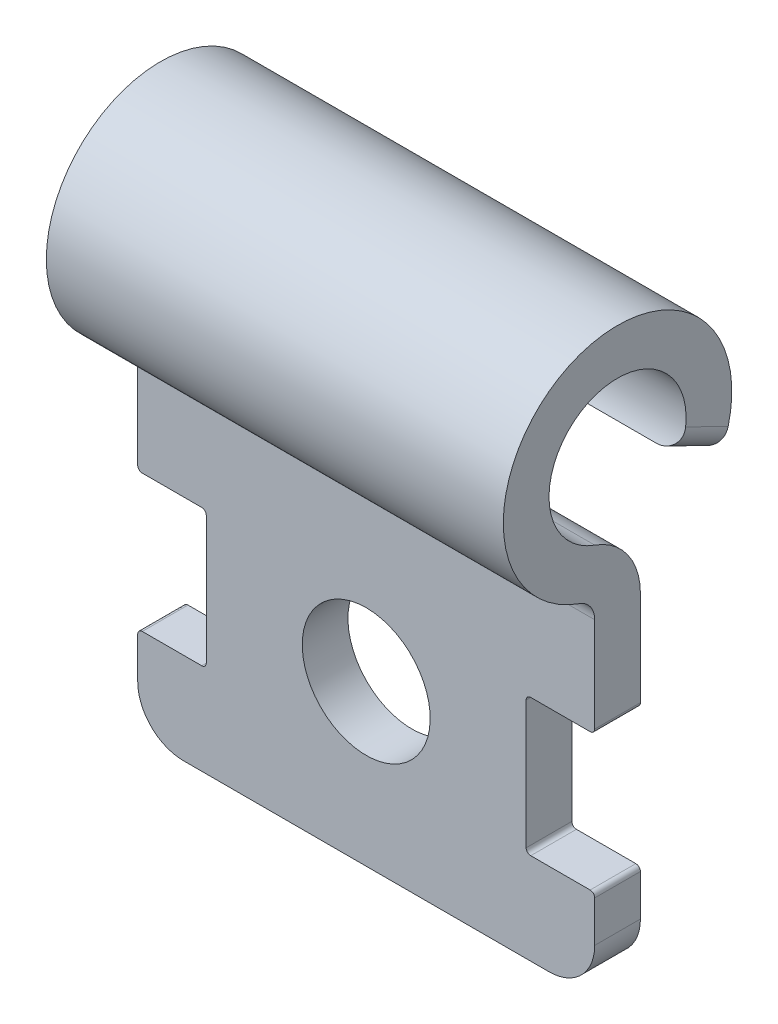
ISO-10303-21;
HEADER;
FILE_DESCRIPTION(('STEP AP214'),'2;1');
FILE_NAME('part.step','',(''),(''),'','','');
FILE_SCHEMA(('AUTOMOTIVE_DESIGN { 1 0 10303 214 1 1 1 1 }'));
ENDSEC;
DATA;
#1=APPLICATION_CONTEXT('core data for automotive mechanical design processes');
#2=APPLICATION_PROTOCOL_DEFINITION('international standard','automotive_design',2000,#1);
#3=PRODUCT_CONTEXT('',#1,'mechanical');
#4=PRODUCT('Part','Part','',(#3));
#5=PRODUCT_RELATED_PRODUCT_CATEGORY('part','',(#4));
#6=PRODUCT_DEFINITION_FORMATION('','',#4);
#7=PRODUCT_DEFINITION_CONTEXT('part definition',#1,'design');
#8=PRODUCT_DEFINITION('design','',#6,#7);
#9=PRODUCT_DEFINITION_SHAPE('','',#8);
#10=(LENGTH_UNIT() NAMED_UNIT(*) SI_UNIT(.MILLI.,.METRE.));
#11=(NAMED_UNIT(*) PLANE_ANGLE_UNIT() SI_UNIT($,.RADIAN.));
#12=(NAMED_UNIT(*) SI_UNIT($,.STERADIAN.) SOLID_ANGLE_UNIT());
#13=UNCERTAINTY_MEASURE_WITH_UNIT(LENGTH_MEASURE(1.E-05),#10,'distance_accuracy_value','');
#14=(GEOMETRIC_REPRESENTATION_CONTEXT(3) GLOBAL_UNCERTAINTY_ASSIGNED_CONTEXT((#13)) GLOBAL_UNIT_ASSIGNED_CONTEXT((#10,
#11,#12)) REPRESENTATION_CONTEXT('',''));
#15=CARTESIAN_POINT('',(0.,0.,0.));
#16=DIRECTION('',(0.,0.,1.));
#17=DIRECTION('',(1.,0.,0.));
#18=AXIS2_PLACEMENT_3D('',#15,#16,#17);
#19=CARTESIAN_POINT('',(10.,-2.82842712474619,1.));
#20=DIRECTION('',(1.,0.,0.));
#21=DIRECTION('',(0.,0.,-1.));
#22=AXIS2_PLACEMENT_3D('',#19,#20,#21);
#23=PLANE('',#22);
#24=DIRECTION('',(0.,-1.,0.));
#25=VECTOR('',#24,1.);
#26=CARTESIAN_POINT('',(10.,-2.82842712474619,-0.5));
#27=LINE('',#26,#25);
#28=CARTESIAN_POINT('',(10.,-8.1,-0.500000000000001));
#29=VERTEX_POINT('',#28);
#30=CARTESIAN_POINT('',(10.,-9.,-0.500000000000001));
#31=VERTEX_POINT('',#30);
#32=EDGE_CURVE('E243',#29,#31,#27,.T.);
#33=ORIENTED_EDGE('',*,*,#32,.F.);
#34=DIRECTION('',(0.,0.,-1.));
#35=VECTOR('',#34,1.);
#36=CARTESIAN_POINT('',(10.,-8.1,0.5));
#37=LINE('',#36,#35);
#38=CARTESIAN_POINT('',(10.,-8.1,0.499999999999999));
#39=VERTEX_POINT('',#38);
#40=EDGE_CURVE('E457',#29,#39,#37,.F.);
#41=ORIENTED_EDGE('',*,*,#40,.T.);
#42=DIRECTION('',(0.,-1.,0.));
#43=VECTOR('',#42,1.);
#44=CARTESIAN_POINT('',(10.,-2.82842712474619,0.5));
#45=LINE('',#44,#43);
#46=CARTESIAN_POINT('',(10.,-9.,0.499999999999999));
#47=VERTEX_POINT('',#46);
#48=EDGE_CURVE('E272',#39,#47,#45,.T.);
#49=ORIENTED_EDGE('',*,*,#48,.T.);
#50=DIRECTION('',(0.,0.,1.));
#51=VECTOR('',#50,1.);
#52=CARTESIAN_POINT('',(10.,-9.,1.));
#53=LINE('',#52,#51);
#54=EDGE_CURVE('E532',#47,#31,#53,.F.);
#55=ORIENTED_EDGE('',*,*,#54,.T.);
#56=EDGE_LOOP('',(#33,#41,#49,#55));
#57=FACE_BOUND('',#56,.T.);
#58=ADVANCED_FACE('F35',(#57),#23,.T.);
#59=CARTESIAN_POINT('',(0.,-2.82842712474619,1.));
#60=DIRECTION('',(1.,0.,0.));
#61=DIRECTION('',(0.,0.,-1.));
#62=AXIS2_PLACEMENT_3D('',#59,#60,#61);
#63=PLANE('',#62);
#64=DIRECTION('',(0.,-1.,0.));
#65=VECTOR('',#64,1.);
#66=CARTESIAN_POINT('',(0.,-2.82842712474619,-0.5));
#67=LINE('',#66,#65);
#68=CARTESIAN_POINT('',(0.,-2.82842712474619,-0.5));
#69=VERTEX_POINT('',#68);
#70=CARTESIAN_POINT('',(0.,-4.9,-0.500000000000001));
#71=VERTEX_POINT('',#70);
#72=EDGE_CURVE('E227',#69,#71,#67,.T.);
#73=ORIENTED_EDGE('',*,*,#72,.T.);
#74=DIRECTION('',(0.,0.,1.));
#75=VECTOR('',#74,1.);
#76=CARTESIAN_POINT('',(0.,-4.9,1.));
#77=LINE('',#76,#75);
#78=CARTESIAN_POINT('',(0.,-4.9,0.499999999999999));
#79=VERTEX_POINT('',#78);
#80=EDGE_CURVE('E389',#71,#79,#77,.T.);
#81=ORIENTED_EDGE('',*,*,#80,.T.);
#82=DIRECTION('',(0.,-1.,0.));
#83=VECTOR('',#82,1.);
#84=CARTESIAN_POINT('',(0.,-2.82842712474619,0.5));
#85=LINE('',#84,#83);
#86=CARTESIAN_POINT('',(0.,-2.82842712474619,0.5));
#87=VERTEX_POINT('',#86);
#88=EDGE_CURVE('E258',#87,#79,#85,.T.);
#89=ORIENTED_EDGE('',*,*,#88,.F.);
#90=CARTESIAN_POINT('',(0.,-2.82842712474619,1.));
#91=DIRECTION('',(-1.,0.,0.));
#92=DIRECTION('',(0.,0.,-1.));
#93=AXIS2_PLACEMENT_3D('',#90,#91,#92);
#94=CIRCLE('',#93,0.5);
#95=CARTESIAN_POINT('',(0.,-2.35702260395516,0.833333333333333));
#96=VERTEX_POINT('',#95);
#97=EDGE_CURVE('E270',#96,#87,#94,.T.);
#98=ORIENTED_EDGE('',*,*,#97,.F.);
#99=CARTESIAN_POINT('',(0.,0.,0.));
#100=DIRECTION('',(1.,0.,0.));
#101=DIRECTION('',(0.,0.,-1.));
#102=AXIS2_PLACEMENT_3D('',#99,#100,#101);
#103=CIRCLE('',#102,2.5);
#104=CARTESIAN_POINT('',(0.,-0.624305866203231,-2.42079370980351));
#105=VERTEX_POINT('',#104);
#106=EDGE_CURVE('E268',#105,#96,#103,.T.);
#107=ORIENTED_EDGE('',*,*,#106,.F.);
#108=DIRECTION('',(0.,0.43834042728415,0.898809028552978));
#109=VECTOR('',#108,1.);
#110=CARTESIAN_POINT('',(0.,-0.208106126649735,-1.56738375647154));
#111=LINE('',#110,#109);
#112=CARTESIAN_POINT('',(0.,-0.170502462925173,-1.49027813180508));
#113=VERTEX_POINT('',#112);
#114=EDGE_CURVE('E296',#105,#113,#111,.T.);
#115=ORIENTED_EDGE('',*,*,#114,.T.);
#116=CARTESIAN_POINT('',(0.,0.,0.));
#117=DIRECTION('',(1.,0.,0.));
#118=DIRECTION('',(0.,0.,-1.));
#119=AXIS2_PLACEMENT_3D('',#116,#117,#118);
#120=CIRCLE('',#119,1.5);
#121=CARTESIAN_POINT('',(0.,-1.41421356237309,0.5));
#122=VERTEX_POINT('',#121);
#123=EDGE_CURVE('E266',#113,#122,#120,.T.);
#124=ORIENTED_EDGE('',*,*,#123,.T.);
#125=CARTESIAN_POINT('',(0.,-2.82842712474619,1.));
#126=DIRECTION('',(1.,0.,0.));
#127=DIRECTION('',(0.,0.,-1.));
#128=AXIS2_PLACEMENT_3D('',#125,#126,#127);
#129=CIRCLE('',#128,1.5);
#130=EDGE_CURVE('E264',#122,#69,#129,.F.);
#131=ORIENTED_EDGE('',*,*,#130,.T.);
#132=EDGE_LOOP('',(#73,#81,#89,#98,#107,#115,#124,#131));
#133=FACE_BOUND('',#132,.T.);
#134=ADVANCED_FACE('F357',(#133),#63,.F.);
#135=CARTESIAN_POINT('',(10.,-2.82842712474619,0.5));
#136=DIRECTION('',(0.,0.,-1.));
#137=DIRECTION('',(0.,1.,0.));
#138=AXIS2_PLACEMENT_3D('',#135,#136,#137);
#139=PLANE('',#138);
#140=CARTESIAN_POINT('',(5.,-6.5,0.499999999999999));
#141=DIRECTION('',(0.,0.,-1.));
#142=DIRECTION('',(0.,1.,0.));
#143=AXIS2_PLACEMENT_3D('',#140,#141,#142);
#144=CIRCLE('',#143,1.4);
#145=CARTESIAN_POINT('',(5.,-5.1,0.499999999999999));
#146=VERTEX_POINT('',#145);
#147=EDGE_CURVE('E569',#146,#146,#144,.T.);
#148=ORIENTED_EDGE('',*,*,#147,.T.);
#149=EDGE_LOOP('',(#148));
#150=FACE_BOUND('',#149,.T.);
#151=ORIENTED_EDGE('',*,*,#48,.F.);
#152=CARTESIAN_POINT('',(9.9,-8.1,0.499999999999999));
#153=DIRECTION('',(0.,0.,-1.));
#154=DIRECTION('',(0.,1.,0.));
#155=AXIS2_PLACEMENT_3D('',#152,#153,#154);
#156=CIRCLE('',#155,0.1);
#157=CARTESIAN_POINT('',(9.9,-8.,0.5));
#158=VERTEX_POINT('',#157);
#159=EDGE_CURVE('E464',#39,#158,#156,.F.);
#160=ORIENTED_EDGE('',*,*,#159,.T.);
#161=DIRECTION('',(1.,0.,0.));
#162=VECTOR('',#161,1.);
#163=CARTESIAN_POINT('',(10.,-8.,0.5));
#164=LINE('',#163,#162);
#165=CARTESIAN_POINT('',(8.6,-8.,0.5));
#166=VERTEX_POINT('',#165);
#167=EDGE_CURVE('E547',#166,#158,#164,.T.);
#168=ORIENTED_EDGE('',*,*,#167,.F.);
#169=CARTESIAN_POINT('',(8.6,-7.9,0.499999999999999));
#170=DIRECTION('',(0.,0.,-1.));
#171=DIRECTION('',(0.,1.,0.));
#172=AXIS2_PLACEMENT_3D('',#169,#170,#171);
#173=CIRCLE('',#172,0.1);
#174=CARTESIAN_POINT('',(8.5,-7.9,0.5));
#175=VERTEX_POINT('',#174);
#176=EDGE_CURVE('E392',#166,#175,#173,.T.);
#177=ORIENTED_EDGE('',*,*,#176,.T.);
#178=DIRECTION('',(0.,-1.,0.));
#179=VECTOR('',#178,1.);
#180=CARTESIAN_POINT('',(8.5,-8.,0.5));
#181=LINE('',#180,#179);
#182=CARTESIAN_POINT('',(8.5,-5.1,0.5));
#183=VERTEX_POINT('',#182);
#184=EDGE_CURVE('E557',#183,#175,#181,.T.);
#185=ORIENTED_EDGE('',*,*,#184,.F.);
#186=CARTESIAN_POINT('',(8.6,-5.1,0.499999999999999));
#187=DIRECTION('',(0.,0.,-1.));
#188=DIRECTION('',(0.,1.,0.));
#189=AXIS2_PLACEMENT_3D('',#186,#187,#188);
#190=CIRCLE('',#189,0.1);
#191=CARTESIAN_POINT('',(8.6,-5.,0.5));
#192=VERTEX_POINT('',#191);
#193=EDGE_CURVE('E403',#183,#192,#190,.T.);
#194=ORIENTED_EDGE('',*,*,#193,.T.);
#195=DIRECTION('',(-1.,0.,0.));
#196=VECTOR('',#195,1.);
#197=CARTESIAN_POINT('',(10.,-5.,0.5));
#198=LINE('',#197,#196);
#199=CARTESIAN_POINT('',(9.9,-5.,0.5));
#200=VERTEX_POINT('',#199);
#201=EDGE_CURVE('E554',#200,#192,#198,.T.);
#202=ORIENTED_EDGE('',*,*,#201,.F.);
#203=CARTESIAN_POINT('',(9.9,-4.9,0.499999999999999));
#204=DIRECTION('',(0.,0.,-1.));
#205=DIRECTION('',(0.,1.,0.));
#206=AXIS2_PLACEMENT_3D('',#203,#204,#205);
#207=CIRCLE('',#206,0.1);
#208=CARTESIAN_POINT('',(10.,-4.9,0.499999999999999));
#209=VERTEX_POINT('',#208);
#210=EDGE_CURVE('E462',#200,#209,#207,.F.);
#211=ORIENTED_EDGE('',*,*,#210,.T.);
#212=CARTESIAN_POINT('',(10.,-2.82842712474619,0.5));
#213=VERTEX_POINT('',#212);
#214=EDGE_CURVE('E386',#213,#209,#45,.T.);
#215=ORIENTED_EDGE('',*,*,#214,.F.);
#216=DIRECTION('',(-1.,0.,0.));
#217=VECTOR('',#216,1.);
#218=CARTESIAN_POINT('',(10.,-2.82842712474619,0.5));
#219=LINE('',#218,#217);
#220=EDGE_CURVE('E257',#213,#87,#219,.T.);
#221=ORIENTED_EDGE('',*,*,#220,.T.);
#222=ORIENTED_EDGE('',*,*,#88,.T.);
#223=CARTESIAN_POINT('',(0.1,-4.9,0.499999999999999));
#224=DIRECTION('',(0.,0.,-1.));
#225=DIRECTION('',(0.,1.,0.));
#226=AXIS2_PLACEMENT_3D('',#223,#224,#225);
#227=CIRCLE('',#226,0.1);
#228=CARTESIAN_POINT('',(0.0999999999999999,-5.,0.5));
#229=VERTEX_POINT('',#228);
#230=EDGE_CURVE('E459',#79,#229,#227,.F.);
#231=ORIENTED_EDGE('',*,*,#230,.T.);
#232=DIRECTION('',(-1.,0.,0.));
#233=VECTOR('',#232,1.);
#234=CARTESIAN_POINT('',(0.,-5.,0.5));
#235=LINE('',#234,#233);
#236=CARTESIAN_POINT('',(1.4,-5.,0.5));
#237=VERTEX_POINT('',#236);
#238=EDGE_CURVE('E413',#237,#229,#235,.T.);
#239=ORIENTED_EDGE('',*,*,#238,.F.);
#240=CARTESIAN_POINT('',(1.4,-5.1,0.499999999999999));
#241=DIRECTION('',(0.,0.,-1.));
#242=DIRECTION('',(0.,1.,0.));
#243=AXIS2_PLACEMENT_3D('',#240,#241,#242);
#244=CIRCLE('',#243,0.1);
#245=CARTESIAN_POINT('',(1.5,-5.1,0.5));
#246=VERTEX_POINT('',#245);
#247=EDGE_CURVE('E43',#237,#246,#244,.T.);
#248=ORIENTED_EDGE('',*,*,#247,.T.);
#249=DIRECTION('',(0.,1.,0.));
#250=VECTOR('',#249,1.);
#251=CARTESIAN_POINT('',(1.5,-8.,0.5));
#252=LINE('',#251,#250);
#253=CARTESIAN_POINT('',(1.5,-7.9,0.5));
#254=VERTEX_POINT('',#253);
#255=EDGE_CURVE('E411',#254,#246,#252,.T.);
#256=ORIENTED_EDGE('',*,*,#255,.F.);
#257=CARTESIAN_POINT('',(1.4,-7.9,0.499999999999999));
#258=DIRECTION('',(0.,0.,-1.));
#259=DIRECTION('',(0.,1.,0.));
#260=AXIS2_PLACEMENT_3D('',#257,#258,#259);
#261=CIRCLE('',#260,0.1);
#262=CARTESIAN_POINT('',(1.4,-8.,0.5));
#263=VERTEX_POINT('',#262);
#264=EDGE_CURVE('E56',#254,#263,#261,.T.);
#265=ORIENTED_EDGE('',*,*,#264,.T.);
#266=DIRECTION('',(1.,0.,0.));
#267=VECTOR('',#266,1.);
#268=CARTESIAN_POINT('',(0.,-8.,0.5));
#269=LINE('',#268,#267);
#270=CARTESIAN_POINT('',(0.1,-8.,0.5));
#271=VERTEX_POINT('',#270);
#272=EDGE_CURVE('E424',#271,#263,#269,.T.);
#273=ORIENTED_EDGE('',*,*,#272,.F.);
#274=CARTESIAN_POINT('',(0.1,-8.1,0.499999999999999));
#275=DIRECTION('',(0.,0.,-1.));
#276=DIRECTION('',(0.,1.,0.));
#277=AXIS2_PLACEMENT_3D('',#274,#275,#276);
#278=CIRCLE('',#277,0.1);
#279=CARTESIAN_POINT('',(0.,-8.1,0.499999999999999));
#280=VERTEX_POINT('',#279);
#281=EDGE_CURVE('E50',#271,#280,#278,.F.);
#282=ORIENTED_EDGE('',*,*,#281,.T.);
#283=CARTESIAN_POINT('',(0.,-9.,0.499999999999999));
#284=VERTEX_POINT('',#283);
#285=EDGE_CURVE('E262',#280,#284,#85,.T.);
#286=ORIENTED_EDGE('',*,*,#285,.T.);
#287=CARTESIAN_POINT('',(1.,-9.,0.499999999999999));
#288=DIRECTION('',(0.,0.,-1.));
#289=DIRECTION('',(0.,1.,0.));
#290=AXIS2_PLACEMENT_3D('',#287,#288,#289);
#291=CIRCLE('',#290,1.);
#292=CARTESIAN_POINT('',(0.999999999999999,-10.,0.499999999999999));
#293=VERTEX_POINT('',#292);
#294=EDGE_CURVE('E578',#284,#293,#291,.F.);
#295=ORIENTED_EDGE('',*,*,#294,.T.);
#296=DIRECTION('',(-1.,0.,0.));
#297=VECTOR('',#296,1.);
#298=CARTESIAN_POINT('',(10.,-10.,0.499999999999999));
#299=LINE('',#298,#297);
#300=CARTESIAN_POINT('',(9.,-10.,0.499999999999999));
#301=VERTEX_POINT('',#300);
#302=EDGE_CURVE('E287',#301,#293,#299,.T.);
#303=ORIENTED_EDGE('',*,*,#302,.F.);
#304=CARTESIAN_POINT('',(9.,-9.,0.499999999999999));
#305=DIRECTION('',(0.,0.,-1.));
#306=DIRECTION('',(0.,1.,0.));
#307=AXIS2_PLACEMENT_3D('',#304,#305,#306);
#308=CIRCLE('',#307,1.);
#309=EDGE_CURVE('E536',#301,#47,#308,.F.);
#310=ORIENTED_EDGE('',*,*,#309,.T.);
#311=EDGE_LOOP('',(#151,#160,#168,#177,#185,#194,#202,#211,#215,#221,#222,#231,#239,#248,#256,
#265,#273,#282,#286,#295,#303,#310));
#312=FACE_BOUND('',#311,.T.);
#313=ADVANCED_FACE('F363',(#150,#312),#139,.F.);
#314=CARTESIAN_POINT('',(10.,-10.,-0.500000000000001));
#315=DIRECTION('',(0.,-1.,0.));
#316=DIRECTION('',(0.,0.,-1.));
#317=AXIS2_PLACEMENT_3D('',#314,#315,#316);
#318=PLANE('',#317);
#319=DIRECTION('',(-1.,0.,0.));
#320=VECTOR('',#319,1.);
#321=CARTESIAN_POINT('',(10.,-10.,-0.500000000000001));
#322=LINE('',#321,#320);
#323=CARTESIAN_POINT('',(9.,-10.,-0.500000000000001));
#324=VERTEX_POINT('',#323);
#325=CARTESIAN_POINT('',(0.999999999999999,-10.,-0.500000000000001));
#326=VERTEX_POINT('',#325);
#327=EDGE_CURVE('E232',#324,#326,#322,.T.);
#328=ORIENTED_EDGE('',*,*,#327,.F.);
#329=DIRECTION('',(0.,0.,1.));
#330=VECTOR('',#329,1.);
#331=CARTESIAN_POINT('',(9.,-10.,-0.500000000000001));
#332=LINE('',#331,#330);
#333=EDGE_CURVE('E579',#324,#301,#332,.T.);
#334=ORIENTED_EDGE('',*,*,#333,.T.);
#335=ORIENTED_EDGE('',*,*,#302,.T.);
#336=DIRECTION('',(0.,0.,1.));
#337=VECTOR('',#336,1.);
#338=CARTESIAN_POINT('',(1.,-10.,-0.500000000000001));
#339=LINE('',#338,#337);
#340=EDGE_CURVE('E528',#293,#326,#339,.F.);
#341=ORIENTED_EDGE('',*,*,#340,.T.);
#342=EDGE_LOOP('',(#328,#334,#335,#341));
#343=FACE_BOUND('',#342,.T.);
#344=ADVANCED_FACE('F582',(#343),#318,.T.);
#345=CARTESIAN_POINT('',(10.,-2.82842712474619,-0.5));
#346=DIRECTION('',(0.,0.,-1.));
#347=DIRECTION('',(0.,1.,0.));
#348=AXIS2_PLACEMENT_3D('',#345,#346,#347);
#349=PLANE('',#348);
#350=DIRECTION('',(-1.,0.,0.));
#351=VECTOR('',#350,1.);
#352=CARTESIAN_POINT('',(9.99999999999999,-8.,-0.500000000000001));
#353=LINE('',#352,#351);
#354=CARTESIAN_POINT('',(9.9,-8.,-0.500000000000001));
#355=VERTEX_POINT('',#354);
#356=CARTESIAN_POINT('',(8.6,-8.,-0.500000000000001));
#357=VERTEX_POINT('',#356);
#358=EDGE_CURVE('E549',#355,#357,#353,.T.);
#359=ORIENTED_EDGE('',*,*,#358,.F.);
#360=CARTESIAN_POINT('',(9.9,-8.1,-0.500000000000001));
#361=DIRECTION('',(0.,0.,-1.));
#362=DIRECTION('',(0.,1.,0.));
#363=AXIS2_PLACEMENT_3D('',#360,#361,#362);
#364=CIRCLE('',#363,0.1);
#365=EDGE_CURVE('E455',#355,#29,#364,.T.);
#366=ORIENTED_EDGE('',*,*,#365,.T.);
#367=ORIENTED_EDGE('',*,*,#32,.T.);
#368=CARTESIAN_POINT('',(9.,-9.,-0.500000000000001));
#369=DIRECTION('',(0.,0.,-1.));
#370=DIRECTION('',(0.,1.,0.));
#371=AXIS2_PLACEMENT_3D('',#368,#369,#370);
#372=CIRCLE('',#371,1.);
#373=EDGE_CURVE('E531',#31,#324,#372,.T.);
#374=ORIENTED_EDGE('',*,*,#373,.T.);
#375=ORIENTED_EDGE('',*,*,#327,.T.);
#376=CARTESIAN_POINT('',(1.,-9.,-0.500000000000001));
#377=DIRECTION('',(0.,0.,-1.));
#378=DIRECTION('',(0.,1.,0.));
#379=AXIS2_PLACEMENT_3D('',#376,#377,#378);
#380=CIRCLE('',#379,1.);
#381=CARTESIAN_POINT('',(0.,-9.,-0.500000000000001));
#382=VERTEX_POINT('',#381);
#383=EDGE_CURVE('E526',#326,#382,#380,.T.);
#384=ORIENTED_EDGE('',*,*,#383,.T.);
#385=CARTESIAN_POINT('',(0.,-8.1,-0.500000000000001));
#386=VERTEX_POINT('',#385);
#387=EDGE_CURVE('E261',#386,#382,#67,.T.);
#388=ORIENTED_EDGE('',*,*,#387,.F.);
#389=CARTESIAN_POINT('',(0.1,-8.1,-0.500000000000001));
#390=DIRECTION('',(0.,0.,-1.));
#391=DIRECTION('',(0.,1.,0.));
#392=AXIS2_PLACEMENT_3D('',#389,#390,#391);
#393=CIRCLE('',#392,0.1);
#394=CARTESIAN_POINT('',(0.0999999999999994,-8.,-0.500000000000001));
#395=VERTEX_POINT('',#394);
#396=EDGE_CURVE('E444',#386,#395,#393,.T.);
#397=ORIENTED_EDGE('',*,*,#396,.T.);
#398=DIRECTION('',(-1.,0.,0.));
#399=VECTOR('',#398,1.);
#400=CARTESIAN_POINT('',(10.,-8.,-0.500000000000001));
#401=LINE('',#400,#399);
#402=CARTESIAN_POINT('',(1.4,-8.,-0.500000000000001));
#403=VERTEX_POINT('',#402);
#404=EDGE_CURVE('E442',#403,#395,#401,.T.);
#405=ORIENTED_EDGE('',*,*,#404,.F.);
#406=CARTESIAN_POINT('',(1.4,-7.9,-0.500000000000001));
#407=DIRECTION('',(0.,0.,-1.));
#408=DIRECTION('',(0.,1.,0.));
#409=AXIS2_PLACEMENT_3D('',#406,#407,#408);
#410=CIRCLE('',#409,0.1);
#411=CARTESIAN_POINT('',(1.5,-7.9,-0.500000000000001));
#412=VERTEX_POINT('',#411);
#413=EDGE_CURVE('E408',#403,#412,#410,.F.);
#414=ORIENTED_EDGE('',*,*,#413,.T.);
#415=DIRECTION('',(0.,-1.,0.));
#416=VECTOR('',#415,1.);
#417=CARTESIAN_POINT('',(1.5,-2.82842712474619,-0.5));
#418=LINE('',#417,#416);
#419=CARTESIAN_POINT('',(1.5,-5.1,-0.500000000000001));
#420=VERTEX_POINT('',#419);
#421=EDGE_CURVE('E290',#420,#412,#418,.T.);
#422=ORIENTED_EDGE('',*,*,#421,.F.);
#423=CARTESIAN_POINT('',(1.4,-5.1,-0.500000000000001));
#424=DIRECTION('',(0.,0.,-1.));
#425=DIRECTION('',(0.,1.,0.));
#426=AXIS2_PLACEMENT_3D('',#423,#424,#425);
#427=CIRCLE('',#426,0.1);
#428=CARTESIAN_POINT('',(1.4,-5.,-0.500000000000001));
#429=VERTEX_POINT('',#428);
#430=EDGE_CURVE('E11',#420,#429,#427,.F.);
#431=ORIENTED_EDGE('',*,*,#430,.T.);
#432=DIRECTION('',(1.,0.,0.));
#433=VECTOR('',#432,1.);
#434=CARTESIAN_POINT('',(10.,-5.,-0.500000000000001));
#435=LINE('',#434,#433);
#436=CARTESIAN_POINT('',(0.0999999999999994,-5.,-0.500000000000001));
#437=VERTEX_POINT('',#436);
#438=EDGE_CURVE('E439',#437,#429,#435,.T.);
#439=ORIENTED_EDGE('',*,*,#438,.F.);
#440=CARTESIAN_POINT('',(0.1,-4.9,-0.5));
#441=DIRECTION('',(0.,0.,-1.));
#442=DIRECTION('',(0.,1.,0.));
#443=AXIS2_PLACEMENT_3D('',#440,#441,#442);
#444=CIRCLE('',#443,0.1);
#445=EDGE_CURVE('E440',#437,#71,#444,.T.);
#446=ORIENTED_EDGE('',*,*,#445,.T.);
#447=ORIENTED_EDGE('',*,*,#72,.F.);
#448=DIRECTION('',(-1.,0.,0.));
#449=VECTOR('',#448,1.);
#450=CARTESIAN_POINT('',(10.,-2.82842712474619,-0.5));
#451=LINE('',#450,#449);
#452=CARTESIAN_POINT('',(10.,-2.82842712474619,-0.5));
#453=VERTEX_POINT('',#452);
#454=EDGE_CURVE('E219',#453,#69,#451,.T.);
#455=ORIENTED_EDGE('',*,*,#454,.F.);
#456=CARTESIAN_POINT('',(10.,-4.9,-0.500000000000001));
#457=VERTEX_POINT('',#456);
#458=EDGE_CURVE('E224',#453,#457,#27,.T.);
#459=ORIENTED_EDGE('',*,*,#458,.T.);
#460=CARTESIAN_POINT('',(9.9,-4.9,-0.500000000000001));
#461=DIRECTION('',(0.,0.,-1.));
#462=DIRECTION('',(0.,1.,0.));
#463=AXIS2_PLACEMENT_3D('',#460,#461,#462);
#464=CIRCLE('',#463,0.1);
#465=CARTESIAN_POINT('',(9.9,-5.,-0.500000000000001));
#466=VERTEX_POINT('',#465);
#467=EDGE_CURVE('E447',#457,#466,#464,.T.);
#468=ORIENTED_EDGE('',*,*,#467,.T.);
#469=DIRECTION('',(1.,0.,0.));
#470=VECTOR('',#469,1.);
#471=CARTESIAN_POINT('',(10.,-5.,-0.500000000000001));
#472=LINE('',#471,#470);
#473=CARTESIAN_POINT('',(8.6,-5.,-0.500000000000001));
#474=VERTEX_POINT('',#473);
#475=EDGE_CURVE('E561',#474,#466,#472,.T.);
#476=ORIENTED_EDGE('',*,*,#475,.F.);
#477=CARTESIAN_POINT('',(8.6,-5.1,-0.500000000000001));
#478=DIRECTION('',(0.,0.,-1.));
#479=DIRECTION('',(0.,1.,0.));
#480=AXIS2_PLACEMENT_3D('',#477,#478,#479);
#481=CIRCLE('',#480,0.1);
#482=CARTESIAN_POINT('',(8.5,-5.1,-0.500000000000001));
#483=VERTEX_POINT('',#482);
#484=EDGE_CURVE('E405',#474,#483,#481,.F.);
#485=ORIENTED_EDGE('',*,*,#484,.T.);
#486=DIRECTION('',(0.,1.,0.));
#487=VECTOR('',#486,1.);
#488=CARTESIAN_POINT('',(8.5,-2.82842712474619,-0.5));
#489=LINE('',#488,#487);
#490=CARTESIAN_POINT('',(8.5,-7.9,-0.500000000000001));
#491=VERTEX_POINT('',#490);
#492=EDGE_CURVE('E293',#491,#483,#489,.T.);
#493=ORIENTED_EDGE('',*,*,#492,.F.);
#494=CARTESIAN_POINT('',(8.6,-7.9,-0.500000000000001));
#495=DIRECTION('',(0.,0.,-1.));
#496=DIRECTION('',(0.,1.,0.));
#497=AXIS2_PLACEMENT_3D('',#494,#495,#496);
#498=CIRCLE('',#497,0.1);
#499=EDGE_CURVE('E395',#491,#357,#498,.F.);
#500=ORIENTED_EDGE('',*,*,#499,.T.);
#501=EDGE_LOOP('',(#359,#366,#367,#374,#375,#384,#388,#397,#405,#414,#422,#431,#439,#446,#447,
#455,#459,#468,#476,#485,#493,#500));
#502=FACE_BOUND('',#501,.T.);
#503=CARTESIAN_POINT('',(5.,-6.5,-0.5));
#504=DIRECTION('',(0.,0.,-1.));
#505=DIRECTION('',(0.,1.,0.));
#506=AXIS2_PLACEMENT_3D('',#503,#504,#505);
#507=CIRCLE('',#506,1.4);
#508=CARTESIAN_POINT('',(5.,-5.1,-0.5));
#509=VERTEX_POINT('',#508);
#510=EDGE_CURVE('E441',#509,#509,#507,.T.);
#511=ORIENTED_EDGE('',*,*,#510,.F.);
#512=EDGE_LOOP('',(#511));
#513=FACE_BOUND('',#512,.T.);
#514=ADVANCED_FACE('F222',(#502,#513),#349,.T.);
#515=CARTESIAN_POINT('',(10.,-2.82842712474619,1.));
#516=DIRECTION('',(-1.,0.,0.));
#517=DIRECTION('',(0.,0.,1.));
#518=AXIS2_PLACEMENT_3D('',#515,#516,#517);
#519=CYLINDRICAL_SURFACE('',#518,1.5);
#520=ORIENTED_EDGE('',*,*,#130,.F.);
#521=DIRECTION('',(-1.,0.,0.));
#522=VECTOR('',#521,1.);
#523=CARTESIAN_POINT('',(10.,-1.41421356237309,0.5));
#524=LINE('',#523,#522);
#525=CARTESIAN_POINT('',(10.,-1.41421356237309,0.5));
#526=VERTEX_POINT('',#525);
#527=EDGE_CURVE('E233',#526,#122,#524,.T.);
#528=ORIENTED_EDGE('',*,*,#527,.F.);
#529=CARTESIAN_POINT('',(10.,-2.82842712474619,1.));
#530=DIRECTION('',(1.,0.,0.));
#531=DIRECTION('',(0.,0.,-1.));
#532=AXIS2_PLACEMENT_3D('',#529,#530,#531);
#533=CIRCLE('',#532,1.5);
#534=EDGE_CURVE('E240',#526,#453,#533,.F.);
#535=ORIENTED_EDGE('',*,*,#534,.T.);
#536=ORIENTED_EDGE('',*,*,#454,.T.);
#537=EDGE_LOOP('',(#520,#528,#535,#536));
#538=FACE_BOUND('',#537,.T.);
#539=ADVANCED_FACE('F246',(#538),#519,.T.);
#540=CARTESIAN_POINT('',(10.,0.,0.));
#541=DIRECTION('',(-1.,0.,0.));
#542=DIRECTION('',(0.,0.,1.));
#543=AXIS2_PLACEMENT_3D('',#540,#541,#542);
#544=CYLINDRICAL_SURFACE('',#543,1.5);
#545=ORIENTED_EDGE('',*,*,#123,.F.);
#546=CARTESIAN_POINT('',(0.,-0.170502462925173,-1.49027813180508));
#547=CARTESIAN_POINT('',(-3.14927919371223E-05,-0.198300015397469,-1.4871274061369));
#548=CARTESIAN_POINT('',(0.00208526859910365,-0.226024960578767,-1.48313903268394));
#549=CARTESIAN_POINT('',(0.0106651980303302,-0.280554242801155,-1.47378124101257));
#550=CARTESIAN_POINT('',(0.0171288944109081,-0.307358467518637,-1.46841165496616));
#551=CARTESIAN_POINT('',(0.0344713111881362,-0.35931976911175,-1.45657384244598));
#552=CARTESIAN_POINT('',(0.0453595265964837,-0.384473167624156,-1.45010327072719));
#553=CARTESIAN_POINT('',(0.0713294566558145,-0.432309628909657,-1.43656710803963));
#554=CARTESIAN_POINT('',(0.0864079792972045,-0.45499455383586,-1.42950197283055));
#555=CARTESIAN_POINT('',(0.119887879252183,-0.496710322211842,-1.41553899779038));
#556=CARTESIAN_POINT('',(0.138184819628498,-0.515825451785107,-1.40864198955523));
#557=CARTESIAN_POINT('',(0.177873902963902,-0.550746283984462,-1.39535956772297));
#558=CARTESIAN_POINT('',(0.199267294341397,-0.566550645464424,-1.38897436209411));
#559=CARTESIAN_POINT('',(0.244792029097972,-0.594688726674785,-1.37716431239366));
#560=CARTESIAN_POINT('',(0.268949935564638,-0.606983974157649,-1.37175033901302));
#561=CARTESIAN_POINT('',(0.319146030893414,-0.627671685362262,-1.36240865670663));
#562=CARTESIAN_POINT('',(0.345183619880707,-0.636065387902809,-1.35848047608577));
#563=CARTESIAN_POINT('',(0.392694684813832,-0.647455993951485,-1.35308263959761));
#564=CARTESIAN_POINT('',(0.413948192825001,-0.651224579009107,-1.35126625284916));
#565=CARTESIAN_POINT('',(0.456798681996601,-0.65625202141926,-1.34882725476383));
#566=CARTESIAN_POINT('',(0.478395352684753,-0.657513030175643,-1.34820362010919));
#567=CARTESIAN_POINT('',(0.5,-0.657510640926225,-1.34821354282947));
#568=B_SPLINE_CURVE_WITH_KNOTS('',3,(#546,#547,#548,#549,#550,#551,#552,#553,#554,#555,#556,
#557,#558,#559,#560,#561,#562,#563,#564,#565,#566,#567),.UNSPECIFIED.,.F.,.F.,(4,2,2,2,2,2,2,2,
2,2,4),(0.,0.0838673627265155,0.167744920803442,0.251803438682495,0.335798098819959,
0.417449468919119,0.499133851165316,0.581682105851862,0.664204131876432,0.729013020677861,
0.793766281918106),.UNSPECIFIED.);
#569=CARTESIAN_POINT('',(0.5,-0.657510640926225,-1.34821354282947));
#570=VERTEX_POINT('',#569);
#571=EDGE_CURVE('E306',#113,#570,#568,.T.);
#572=ORIENTED_EDGE('',*,*,#571,.T.);
#573=DIRECTION('',(-1.,0.,0.));
#574=VECTOR('',#573,1.);
#575=CARTESIAN_POINT('',(10.,-0.657510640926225,-1.34821354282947));
#576=LINE('',#575,#574);
#577=CARTESIAN_POINT('',(9.5,-0.657510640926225,-1.34821354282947));
#578=VERTEX_POINT('',#577);
#579=EDGE_CURVE('E281',#578,#570,#576,.T.);
#580=ORIENTED_EDGE('',*,*,#579,.F.);
#581=CARTESIAN_POINT('',(9.5,-0.657510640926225,-1.34821354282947));
#582=CARTESIAN_POINT('',(9.52809805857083,-0.657522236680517,-1.34818290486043));
#583=CARTESIAN_POINT('',(9.55618931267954,-0.655382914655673,-1.34925079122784));
#584=CARTESIAN_POINT('',(9.61156277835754,-0.646886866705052,-1.35335783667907));
#585=CARTESIAN_POINT('',(9.63884545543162,-0.640532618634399,-1.3563958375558));
#586=CARTESIAN_POINT('',(9.6918555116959,-0.623686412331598,-1.36421994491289));
#587=CARTESIAN_POINT('',(9.7175820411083,-0.61319221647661,-1.36900699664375));
#588=CARTESIAN_POINT('',(9.76672521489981,-0.58824237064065,-1.37991186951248));
#589=CARTESIAN_POINT('',(9.79014223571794,-0.573787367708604,-1.38602947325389));
#590=CARTESIAN_POINT('',(9.83388832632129,-0.54125847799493,-1.3990509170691));
#591=CARTESIAN_POINT('',(9.85423115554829,-0.523201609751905,-1.40595099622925));
#592=CARTESIAN_POINT('',(9.89136184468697,-0.483822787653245,-1.41998280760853));
#593=CARTESIAN_POINT('',(9.90815062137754,-0.462501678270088,-1.42711447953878));
#594=CARTESIAN_POINT('',(9.93743095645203,-0.417564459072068,-1.44089594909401));
#595=CARTESIAN_POINT('',(9.94999751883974,-0.393999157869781,-1.44755229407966));
#596=CARTESIAN_POINT('',(9.97098815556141,-0.344877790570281,-1.46003448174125));
#597=CARTESIAN_POINT('',(9.97941157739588,-0.319321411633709,-1.46586019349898));
#598=CARTESIAN_POINT('',(9.99052416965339,-0.273198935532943,-1.47505121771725));
#599=CARTESIAN_POINT('',(9.99410037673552,-0.252890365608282,-1.47867221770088));
#600=CARTESIAN_POINT('',(9.99883944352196,-0.211904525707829,-1.48510336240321));
#601=CARTESIAN_POINT('',(10.0000067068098,-0.191227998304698,-1.48791497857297));
#602=CARTESIAN_POINT('',(10.,-0.170502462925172,-1.49027813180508));
#603=B_SPLINE_CURVE_WITH_KNOTS('',3,(#581,#582,#583,#584,#585,#586,#587,#588,#589,#590,#591,
#592,#593,#594,#595,#596,#597,#598,#599,#600,#601,#602),.UNSPECIFIED.,.F.,.F.,(4,2,2,2,2,2,2,2,
2,2,4),(0.,0.0841830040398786,0.168316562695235,0.252495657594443,0.336661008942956,
0.420437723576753,0.504192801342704,0.58636985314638,0.668559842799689,0.731216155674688,
0.793757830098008),.UNSPECIFIED.);
#604=CARTESIAN_POINT('',(10.,-0.170502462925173,-1.49027813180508));
#605=VERTEX_POINT('',#604);
#606=EDGE_CURVE('E299',#578,#605,#603,.T.);
#607=ORIENTED_EDGE('',*,*,#606,.T.);
#608=CARTESIAN_POINT('',(10.,0.,0.));
#609=DIRECTION('',(1.,0.,0.));
#610=DIRECTION('',(0.,0.,-1.));
#611=AXIS2_PLACEMENT_3D('',#608,#609,#610);
#612=CIRCLE('',#611,1.5);
#613=EDGE_CURVE('E248',#605,#526,#612,.T.);
#614=ORIENTED_EDGE('',*,*,#613,.T.);
#615=ORIENTED_EDGE('',*,*,#527,.T.);
#616=EDGE_LOOP('',(#545,#572,#580,#607,#614,#615));
#617=FACE_BOUND('',#616,.T.);
#618=ADVANCED_FACE('F312',(#617),#544,.F.);
#619=CARTESIAN_POINT('',(10.,-1.09585106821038,-2.24702257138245));
#620=DIRECTION('',(0.,-0.898809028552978,0.43834042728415));
#621=DIRECTION('',(0.,-0.43834042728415,-0.898809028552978));
#622=AXIS2_PLACEMENT_3D('',#619,#620,#621);
#623=PLANE('',#622);
#624=ORIENTED_EDGE('',*,*,#579,.T.);
#625=DIRECTION('',(0.,0.43834042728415,0.898809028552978));
#626=VECTOR('',#625,1.);
#627=CARTESIAN_POINT('',(0.5,-1.09585106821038,-2.24702257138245));
#628=LINE('',#627,#626);
#629=CARTESIAN_POINT('',(0.5,-1.09585106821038,-2.24702257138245));
#630=VERTEX_POINT('',#629);
#631=EDGE_CURVE('E336',#570,#630,#628,.F.);
#632=ORIENTED_EDGE('',*,*,#631,.T.);
#633=DIRECTION('',(-1.,0.,0.));
#634=VECTOR('',#633,1.);
#635=CARTESIAN_POINT('',(10.,-1.09585106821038,-2.24702257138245));
#636=LINE('',#635,#634);
#637=CARTESIAN_POINT('',(9.5,-1.09585106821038,-2.24702257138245));
#638=VERTEX_POINT('',#637);
#639=EDGE_CURVE('E278',#638,#630,#636,.T.);
#640=ORIENTED_EDGE('',*,*,#639,.F.);
#641=DIRECTION('',(0.,0.43834042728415,0.898809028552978));
#642=VECTOR('',#641,1.);
#643=CARTESIAN_POINT('',(9.5,-1.09585106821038,-2.24702257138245));
#644=LINE('',#643,#642);
#645=EDGE_CURVE('E597',#638,#578,#644,.T.);
#646=ORIENTED_EDGE('',*,*,#645,.T.);
#647=EDGE_LOOP('',(#624,#632,#640,#646));
#648=FACE_BOUND('',#647,.T.);
#649=ADVANCED_FACE('F346',(#648),#623,.T.);
#650=CARTESIAN_POINT('',(10.,0.,0.));
#651=DIRECTION('',(-1.,0.,0.));
#652=DIRECTION('',(0.,0.,1.));
#653=AXIS2_PLACEMENT_3D('',#650,#651,#652);
#654=CYLINDRICAL_SURFACE('',#653,2.5);
#655=ORIENTED_EDGE('',*,*,#639,.T.);
#656=CARTESIAN_POINT('',(0.5,-1.09585106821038,-2.24702257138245));
#657=CARTESIAN_POINT('',(0.471882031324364,-1.0958666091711,-2.24699996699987));
#658=CARTESIAN_POINT('',(0.443771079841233,-1.09372039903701,-2.24806142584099));
#659=CARTESIAN_POINT('',(0.3883633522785,-1.08521872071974,-2.25218571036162));
#660=CARTESIAN_POINT('',(0.361066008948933,-1.07886626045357,-2.25524710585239));
#661=CARTESIAN_POINT('',(0.308029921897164,-1.06206180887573,-2.26320694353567));
#662=CARTESIAN_POINT('',(0.282291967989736,-1.05160775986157,-2.26810630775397));
#663=CARTESIAN_POINT('',(0.233125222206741,-1.02682659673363,-2.27943265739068));
#664=CARTESIAN_POINT('',(0.209696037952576,-1.01250014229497,-2.28585938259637));
#665=CARTESIAN_POINT('',(0.165849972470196,-0.980316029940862,-2.29984489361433));
#666=CARTESIAN_POINT('',(0.14542810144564,-0.962464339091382,-2.30740176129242));
#667=CARTESIAN_POINT('',(0.108133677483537,-0.923634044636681,-2.32321729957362));
#668=CARTESIAN_POINT('',(0.091261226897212,-0.902655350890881,-2.33147599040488));
#669=CARTESIAN_POINT('',(0.0616443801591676,-0.85825825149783,-2.34818033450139));
#670=CARTESIAN_POINT('',(0.0488726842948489,-0.83485741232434,-2.35662433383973));
#671=CARTESIAN_POINT('',(0.0276353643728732,-0.786117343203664,-2.37332712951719));
#672=CARTESIAN_POINT('',(0.0191684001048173,-0.760778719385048,-2.38158598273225));
#673=CARTESIAN_POINT('',(0.00862432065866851,-0.716829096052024,-2.39510154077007));
#674=CARTESIAN_POINT('',(0.00538476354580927,-0.698531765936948,-2.40050364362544));
#675=CARTESIAN_POINT('',(0.00107249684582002,-0.661612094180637,-2.41094194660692));
#676=CARTESIAN_POINT('',(-3.62547752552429E-06,-0.642990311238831,-2.41597871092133));
#677=CARTESIAN_POINT('',(0.,-0.624305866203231,-2.42079370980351));
#678=B_SPLINE_CURVE_WITH_KNOTS('',3,(#656,#657,#658,#659,#660,#661,#662,#663,#664,#665,#666,
#667,#668,#669,#670,#671,#672,#673,#674,#675,#676,#677),.UNSPECIFIED.,.F.,.F.,(4,2,2,2,2,2,2,2,
2,2,4),(0.,0.0842421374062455,0.168424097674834,0.252648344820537,0.336858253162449,
0.420926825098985,0.504997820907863,0.588496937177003,0.671970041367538,0.729903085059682,
0.787744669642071),.UNSPECIFIED.);
#679=EDGE_CURVE('E335',#630,#105,#678,.T.);
#680=ORIENTED_EDGE('',*,*,#679,.T.);
#681=ORIENTED_EDGE('',*,*,#106,.T.);
#682=DIRECTION('',(-1.,0.,0.));
#683=VECTOR('',#682,1.);
#684=CARTESIAN_POINT('',(10.,-2.35702260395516,0.833333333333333));
#685=LINE('',#684,#683);
#686=CARTESIAN_POINT('',(10.,-2.35702260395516,0.833333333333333));
#687=VERTEX_POINT('',#686);
#688=EDGE_CURVE('E275',#687,#96,#685,.T.);
#689=ORIENTED_EDGE('',*,*,#688,.F.);
#690=CARTESIAN_POINT('',(10.,0.,0.));
#691=DIRECTION('',(1.,0.,0.));
#692=DIRECTION('',(0.,0.,-1.));
#693=AXIS2_PLACEMENT_3D('',#690,#691,#692);
#694=CIRCLE('',#693,2.5);
#695=CARTESIAN_POINT('',(10.,-0.624305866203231,-2.42079370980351));
#696=VERTEX_POINT('',#695);
#697=EDGE_CURVE('E250',#696,#687,#694,.T.);
#698=ORIENTED_EDGE('',*,*,#697,.F.);
#699=CARTESIAN_POINT('',(10.,-0.624305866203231,-2.42079370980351));
#700=CARTESIAN_POINT('',(10.0000272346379,-0.651493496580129,-2.41380089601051));
#701=CARTESIAN_POINT('',(9.99773190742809,-0.678558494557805,-2.40631457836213));
#702=CARTESIAN_POINT('',(9.98858967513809,-0.731696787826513,-2.39068240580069));
#703=CARTESIAN_POINT('',(9.98174492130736,-0.757770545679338,-2.3825368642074));
#704=CARTESIAN_POINT('',(9.96358720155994,-0.808234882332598,-2.36589730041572));
#705=CARTESIAN_POINT('',(9.95226930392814,-0.832623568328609,-2.35740290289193));
#706=CARTESIAN_POINT('',(9.9254638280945,-0.87900977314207,-2.34050208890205));
#707=CARTESIAN_POINT('',(9.90997784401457,-0.901008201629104,-2.33209564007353));
#708=CARTESIAN_POINT('',(9.87544375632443,-0.941839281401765,-2.31590534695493));
#709=CARTESIAN_POINT('',(9.85643413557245,-0.960702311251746,-2.30811596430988));
#710=CARTESIAN_POINT('',(9.81527711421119,-0.99509360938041,-2.29349922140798));
#711=CARTESIAN_POINT('',(9.79312885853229,-1.01062096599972,-2.28667212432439));
#712=CARTESIAN_POINT('',(9.74621783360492,-1.03805129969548,-2.27435209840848));
#713=CARTESIAN_POINT('',(9.7214438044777,-1.04993774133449,-2.26886527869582));
#714=CARTESIAN_POINT('',(9.67006335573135,-1.0697376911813,-2.25959760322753));
#715=CARTESIAN_POINT('',(9.64345783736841,-1.07765313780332,-2.2558159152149));
#716=CARTESIAN_POINT('',(9.59727684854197,-1.08761004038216,-2.25102764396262));
#717=CARTESIAN_POINT('',(9.57796984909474,-1.09069912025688,-2.24952986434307));
#718=CARTESIAN_POINT('',(9.53911111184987,-1.09481926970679,-2.2475257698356));
#719=CARTESIAN_POINT('',(9.51955970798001,-1.09585289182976,-2.24701822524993));
#720=CARTESIAN_POINT('',(9.5,-1.09585106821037,-2.24702257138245));
#721=B_SPLINE_CURVE_WITH_KNOTS('',3,(#699,#700,#701,#702,#703,#704,#705,#706,#707,#708,#709,
#710,#711,#712,#713,#714,#715,#716,#717,#718,#719,#720),.UNSPECIFIED.,.F.,.F.,(4,2,2,2,2,2,2,2,
2,2,4),(0.,0.0841256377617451,0.168211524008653,0.25239037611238,0.336537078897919,
0.419813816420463,0.50311328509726,0.586785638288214,0.670417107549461,0.729119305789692,
0.787748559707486),.UNSPECIFIED.);
#722=EDGE_CURVE('E328',#696,#638,#721,.T.);
#723=ORIENTED_EDGE('',*,*,#722,.T.);
#724=EDGE_LOOP('',(#655,#680,#681,#689,#698,#723));
#725=FACE_BOUND('',#724,.T.);
#726=ADVANCED_FACE('F341',(#725),#654,.T.);
#727=CARTESIAN_POINT('',(10.,-2.82842712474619,1.));
#728=DIRECTION('',(-1.,0.,0.));
#729=DIRECTION('',(0.,0.,1.));
#730=AXIS2_PLACEMENT_3D('',#727,#728,#729);
#731=CYLINDRICAL_SURFACE('',#730,0.5);
#732=ORIENTED_EDGE('',*,*,#97,.T.);
#733=ORIENTED_EDGE('',*,*,#220,.F.);
#734=CARTESIAN_POINT('',(10.,-2.82842712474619,1.));
#735=DIRECTION('',(-1.,0.,0.));
#736=DIRECTION('',(0.,0.,-1.));
#737=AXIS2_PLACEMENT_3D('',#734,#735,#736);
#738=CIRCLE('',#737,0.5);
#739=EDGE_CURVE('E255',#687,#213,#738,.T.);
#740=ORIENTED_EDGE('',*,*,#739,.F.);
#741=ORIENTED_EDGE('',*,*,#688,.T.);
#742=EDGE_LOOP('',(#732,#733,#740,#741));
#743=FACE_BOUND('',#742,.T.);
#744=ADVANCED_FACE('F345',(#743),#731,.F.);
#745=ORIENTED_EDGE('',*,*,#214,.T.);
#746=DIRECTION('',(0.,0.,1.));
#747=VECTOR('',#746,1.);
#748=CARTESIAN_POINT('',(10.,-4.9,-0.5));
#749=LINE('',#748,#747);
#750=EDGE_CURVE('E242',#209,#457,#749,.F.);
#751=ORIENTED_EDGE('',*,*,#750,.T.);
#752=ORIENTED_EDGE('',*,*,#458,.F.);
#753=ORIENTED_EDGE('',*,*,#534,.F.);
#754=ORIENTED_EDGE('',*,*,#613,.F.);
#755=DIRECTION('',(0.,0.43834042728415,0.898809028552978));
#756=VECTOR('',#755,1.);
#757=CARTESIAN_POINT('',(10.,0.299928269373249,-0.525668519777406));
#758=LINE('',#757,#756);
#759=EDGE_CURVE('E583',#605,#696,#758,.F.);
#760=ORIENTED_EDGE('',*,*,#759,.T.);
#761=ORIENTED_EDGE('',*,*,#697,.T.);
#762=ORIENTED_EDGE('',*,*,#739,.T.);
#763=EDGE_LOOP('',(#745,#751,#752,#753,#754,#760,#761,#762));
#764=FACE_BOUND('',#763,.T.);
#765=ADVANCED_FACE('F238',(#764),#23,.T.);
#766=ORIENTED_EDGE('',*,*,#285,.F.);
#767=DIRECTION('',(0.,0.,-1.));
#768=VECTOR('',#767,1.);
#769=CARTESIAN_POINT('',(0.,-8.1,1.));
#770=LINE('',#769,#768);
#771=EDGE_CURVE('E477',#280,#386,#770,.T.);
#772=ORIENTED_EDGE('',*,*,#771,.T.);
#773=ORIENTED_EDGE('',*,*,#387,.T.);
#774=DIRECTION('',(0.,0.,1.));
#775=VECTOR('',#774,1.);
#776=CARTESIAN_POINT('',(0.,-9.,0.499999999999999));
#777=LINE('',#776,#775);
#778=EDGE_CURVE('E530',#382,#284,#777,.T.);
#779=ORIENTED_EDGE('',*,*,#778,.T.);
#780=EDGE_LOOP('',(#766,#772,#773,#779));
#781=FACE_BOUND('',#780,.T.);
#782=ADVANCED_FACE('F365',(#781),#63,.F.);
#783=CARTESIAN_POINT('',(5.,-6.5,2.5));
#784=DIRECTION('',(0.,0.,-1.));
#785=DIRECTION('',(0.,1.,0.));
#786=AXIS2_PLACEMENT_3D('',#783,#784,#785);
#787=CYLINDRICAL_SURFACE('',#786,1.4);
#788=ORIENTED_EDGE('',*,*,#510,.T.);
#789=EDGE_LOOP('',(#788));
#790=FACE_BOUND('',#789,.T.);
#791=ORIENTED_EDGE('',*,*,#147,.F.);
#792=EDGE_LOOP('',(#791));
#793=FACE_BOUND('',#792,.T.);
#794=ADVANCED_FACE('F373',(#790,#793),#787,.F.);
#795=CARTESIAN_POINT('',(0.,-5.,-2.5));
#796=DIRECTION('',(0.,1.,0.));
#797=DIRECTION('',(-1.,0.,0.));
#798=AXIS2_PLACEMENT_3D('',#795,#796,#797);
#799=PLANE('',#798);
#800=ORIENTED_EDGE('',*,*,#438,.T.);
#801=DIRECTION('',(0.,0.,1.));
#802=VECTOR('',#801,1.);
#803=CARTESIAN_POINT('',(1.4,-5.,0.5));
#804=LINE('',#803,#802);
#805=EDGE_CURVE('E393',#429,#237,#804,.T.);
#806=ORIENTED_EDGE('',*,*,#805,.T.);
#807=ORIENTED_EDGE('',*,*,#238,.T.);
#808=DIRECTION('',(0.,0.,1.));
#809=VECTOR('',#808,1.);
#810=CARTESIAN_POINT('',(0.1,-5.,-2.5));
#811=LINE('',#810,#809);
#812=EDGE_CURVE('E398',#229,#437,#811,.F.);
#813=ORIENTED_EDGE('',*,*,#812,.T.);
#814=EDGE_LOOP('',(#800,#806,#807,#813));
#815=FACE_BOUND('',#814,.T.);
#816=ADVANCED_FACE('F438',(#815),#799,.F.);
#817=CARTESIAN_POINT('',(1.5,-8.,-2.5));
#818=DIRECTION('',(1.,0.,0.));
#819=DIRECTION('',(0.,1.,0.));
#820=AXIS2_PLACEMENT_3D('',#817,#818,#819);
#821=PLANE('',#820);
#822=ORIENTED_EDGE('',*,*,#421,.T.);
#823=DIRECTION('',(0.,0.,1.));
#824=VECTOR('',#823,1.);
#825=CARTESIAN_POINT('',(1.5,-7.9,0.5));
#826=LINE('',#825,#824);
#827=EDGE_CURVE('E423',#412,#254,#826,.T.);
#828=ORIENTED_EDGE('',*,*,#827,.T.);
#829=ORIENTED_EDGE('',*,*,#255,.T.);
#830=DIRECTION('',(0.,0.,1.));
#831=VECTOR('',#830,1.);
#832=CARTESIAN_POINT('',(1.5,-5.1,-0.5));
#833=LINE('',#832,#831);
#834=EDGE_CURVE('E420',#246,#420,#833,.F.);
#835=ORIENTED_EDGE('',*,*,#834,.T.);
#836=EDGE_LOOP('',(#822,#828,#829,#835));
#837=FACE_BOUND('',#836,.T.);
#838=ADVANCED_FACE('F419',(#837),#821,.F.);
#839=CARTESIAN_POINT('',(0.,-8.,-2.5));
#840=DIRECTION('',(0.,-1.,0.));
#841=DIRECTION('',(0.,0.,-1.));
#842=AXIS2_PLACEMENT_3D('',#839,#840,#841);
#843=PLANE('',#842);
#844=ORIENTED_EDGE('',*,*,#404,.T.);
#845=DIRECTION('',(0.,0.,-1.));
#846=VECTOR('',#845,1.);
#847=CARTESIAN_POINT('',(0.1,-8.,-2.5));
#848=LINE('',#847,#846);
#849=EDGE_CURVE('E428',#395,#271,#848,.F.);
#850=ORIENTED_EDGE('',*,*,#849,.T.);
#851=ORIENTED_EDGE('',*,*,#272,.T.);
#852=DIRECTION('',(0.,0.,1.));
#853=VECTOR('',#852,1.);
#854=CARTESIAN_POINT('',(1.4,-8.,-0.500000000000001));
#855=LINE('',#854,#853);
#856=EDGE_CURVE('E431',#263,#403,#855,.F.);
#857=ORIENTED_EDGE('',*,*,#856,.T.);
#858=EDGE_LOOP('',(#844,#850,#851,#857));
#859=FACE_BOUND('',#858,.T.);
#860=ADVANCED_FACE('F483',(#859),#843,.F.);
#861=CARTESIAN_POINT('',(10.,-8.,-2.5));
#862=DIRECTION('',(0.,-1.,0.));
#863=DIRECTION('',(1.,0.,0.));
#864=AXIS2_PLACEMENT_3D('',#861,#862,#863);
#865=PLANE('',#864);
#866=ORIENTED_EDGE('',*,*,#167,.T.);
#867=DIRECTION('',(0.,0.,-1.));
#868=VECTOR('',#867,1.);
#869=CARTESIAN_POINT('',(9.9,-8.,-0.5));
#870=LINE('',#869,#868);
#871=EDGE_CURVE('E445',#158,#355,#870,.T.);
#872=ORIENTED_EDGE('',*,*,#871,.T.);
#873=ORIENTED_EDGE('',*,*,#358,.T.);
#874=DIRECTION('',(0.,0.,1.));
#875=VECTOR('',#874,1.);
#876=CARTESIAN_POINT('',(8.6,-8.,0.5));
#877=LINE('',#876,#875);
#878=EDGE_CURVE('E450',#357,#166,#877,.T.);
#879=ORIENTED_EDGE('',*,*,#878,.T.);
#880=EDGE_LOOP('',(#866,#872,#873,#879));
#881=FACE_BOUND('',#880,.T.);
#882=ADVANCED_FACE('F546',(#881),#865,.F.);
#883=CARTESIAN_POINT('',(8.5,-8.,-2.5));
#884=DIRECTION('',(-1.,0.,0.));
#885=DIRECTION('',(0.,0.,1.));
#886=AXIS2_PLACEMENT_3D('',#883,#884,#885);
#887=PLANE('',#886);
#888=ORIENTED_EDGE('',*,*,#184,.T.);
#889=DIRECTION('',(0.,0.,1.));
#890=VECTOR('',#889,1.);
#891=CARTESIAN_POINT('',(8.5,-7.9,-0.5));
#892=LINE('',#891,#890);
#893=EDGE_CURVE('E469',#175,#491,#892,.F.);
#894=ORIENTED_EDGE('',*,*,#893,.T.);
#895=ORIENTED_EDGE('',*,*,#492,.T.);
#896=DIRECTION('',(0.,0.,1.));
#897=VECTOR('',#896,1.);
#898=CARTESIAN_POINT('',(8.5,-5.1,0.5));
#899=LINE('',#898,#897);
#900=EDGE_CURVE('E466',#483,#183,#899,.T.);
#901=ORIENTED_EDGE('',*,*,#900,.T.);
#902=EDGE_LOOP('',(#888,#894,#895,#901));
#903=FACE_BOUND('',#902,.T.);
#904=ADVANCED_FACE('F606',(#903),#887,.F.);
#905=CARTESIAN_POINT('',(10.,-5.,-2.5));
#906=DIRECTION('',(0.,1.,0.));
#907=DIRECTION('',(-1.,0.,0.));
#908=AXIS2_PLACEMENT_3D('',#905,#906,#907);
#909=PLANE('',#908);
#910=ORIENTED_EDGE('',*,*,#201,.T.);
#911=DIRECTION('',(0.,0.,1.));
#912=VECTOR('',#911,1.);
#913=CARTESIAN_POINT('',(8.6,-5.,-0.5));
#914=LINE('',#913,#912);
#915=EDGE_CURVE('E474',#192,#474,#914,.F.);
#916=ORIENTED_EDGE('',*,*,#915,.T.);
#917=ORIENTED_EDGE('',*,*,#475,.T.);
#918=DIRECTION('',(0.,0.,1.));
#919=VECTOR('',#918,1.);
#920=CARTESIAN_POINT('',(9.9,-5.,0.5));
#921=LINE('',#920,#919);
#922=EDGE_CURVE('E471',#466,#200,#921,.T.);
#923=ORIENTED_EDGE('',*,*,#922,.T.);
#924=EDGE_LOOP('',(#910,#916,#917,#923));
#925=FACE_BOUND('',#924,.T.);
#926=ADVANCED_FACE('F602',(#925),#909,.F.);
#927=CARTESIAN_POINT('',(0.5,0.299928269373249,-0.525668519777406));
#928=DIRECTION('',(0.,-0.43834042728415,-0.898809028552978));
#929=DIRECTION('',(0.,0.898809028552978,-0.43834042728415));
#930=AXIS2_PLACEMENT_3D('',#927,#928,#929);
#931=CYLINDRICAL_SURFACE('',#930,0.5);
#932=ORIENTED_EDGE('',*,*,#679,.F.);
#933=ORIENTED_EDGE('',*,*,#631,.F.);
#934=ORIENTED_EDGE('',*,*,#571,.F.);
#935=ORIENTED_EDGE('',*,*,#114,.F.);
#936=EDGE_LOOP('',(#932,#933,#934,#935));
#937=FACE_BOUND('',#936,.T.);
#938=ADVANCED_FACE('F321',(#937),#931,.T.);
#939=CARTESIAN_POINT('',(9.5,-0.646446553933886,-2.46619278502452));
#940=DIRECTION('',(0.,0.43834042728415,0.898809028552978));
#941=DIRECTION('',(0.,-0.898809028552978,0.43834042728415));
#942=AXIS2_PLACEMENT_3D('',#939,#940,#941);
#943=CYLINDRICAL_SURFACE('',#942,0.5);
#944=ORIENTED_EDGE('',*,*,#722,.F.);
#945=ORIENTED_EDGE('',*,*,#759,.F.);
#946=ORIENTED_EDGE('',*,*,#606,.F.);
#947=ORIENTED_EDGE('',*,*,#645,.F.);
#948=EDGE_LOOP('',(#944,#945,#946,#947));
#949=FACE_BOUND('',#948,.T.);
#950=ADVANCED_FACE('F316',(#949),#943,.T.);
#951=CARTESIAN_POINT('',(9.,-9.,-0.500000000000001));
#952=DIRECTION('',(0.,0.,1.));
#953=DIRECTION('',(1.,0.,0.));
#954=AXIS2_PLACEMENT_3D('',#951,#952,#953);
#955=CYLINDRICAL_SURFACE('',#954,1.);
#956=ORIENTED_EDGE('',*,*,#373,.F.);
#957=ORIENTED_EDGE('',*,*,#54,.F.);
#958=ORIENTED_EDGE('',*,*,#309,.F.);
#959=ORIENTED_EDGE('',*,*,#333,.F.);
#960=EDGE_LOOP('',(#956,#957,#958,#959));
#961=FACE_BOUND('',#960,.T.);
#962=ADVANCED_FACE('F320',(#961),#955,.T.);
#963=CARTESIAN_POINT('',(1.,-9.,1.));
#964=DIRECTION('',(0.,0.,-1.));
#965=DIRECTION('',(-1.,0.,0.));
#966=AXIS2_PLACEMENT_3D('',#963,#964,#965);
#967=CYLINDRICAL_SURFACE('',#966,1.);
#968=ORIENTED_EDGE('',*,*,#383,.F.);
#969=ORIENTED_EDGE('',*,*,#340,.F.);
#970=ORIENTED_EDGE('',*,*,#294,.F.);
#971=ORIENTED_EDGE('',*,*,#778,.F.);
#972=EDGE_LOOP('',(#968,#969,#970,#971));
#973=FACE_BOUND('',#972,.T.);
#974=ADVANCED_FACE('F514',(#973),#967,.T.);
#975=CARTESIAN_POINT('',(9.9,-8.1,-2.5));
#976=DIRECTION('',(0.,0.,1.));
#977=DIRECTION('',(1.,0.,0.));
#978=AXIS2_PLACEMENT_3D('',#975,#976,#977);
#979=CYLINDRICAL_SURFACE('',#978,0.1);
#980=ORIENTED_EDGE('',*,*,#159,.F.);
#981=ORIENTED_EDGE('',*,*,#40,.F.);
#982=ORIENTED_EDGE('',*,*,#365,.F.);
#983=ORIENTED_EDGE('',*,*,#871,.F.);
#984=EDGE_LOOP('',(#980,#981,#982,#983));
#985=FACE_BOUND('',#984,.T.);
#986=ADVANCED_FACE('F511',(#985),#979,.T.);
#987=CARTESIAN_POINT('',(8.6,-7.9,-2.5));
#988=DIRECTION('',(0.,0.,-1.));
#989=DIRECTION('',(-1.,0.,0.));
#990=AXIS2_PLACEMENT_3D('',#987,#988,#989);
#991=CYLINDRICAL_SURFACE('',#990,0.1);
#992=ORIENTED_EDGE('',*,*,#499,.F.);
#993=ORIENTED_EDGE('',*,*,#893,.F.);
#994=ORIENTED_EDGE('',*,*,#176,.F.);
#995=ORIENTED_EDGE('',*,*,#878,.F.);
#996=EDGE_LOOP('',(#992,#993,#994,#995));
#997=FACE_BOUND('',#996,.T.);
#998=ADVANCED_FACE('F507',(#997),#991,.F.);
#999=CARTESIAN_POINT('',(8.6,-5.1,-2.5));
#1000=DIRECTION('',(0.,0.,-1.));
#1001=DIRECTION('',(-1.,0.,0.));
#1002=AXIS2_PLACEMENT_3D('',#999,#1000,#1001);
#1003=CYLINDRICAL_SURFACE('',#1002,0.1);
#1004=ORIENTED_EDGE('',*,*,#484,.F.);
#1005=ORIENTED_EDGE('',*,*,#915,.F.);
#1006=ORIENTED_EDGE('',*,*,#193,.F.);
#1007=ORIENTED_EDGE('',*,*,#900,.F.);
#1008=EDGE_LOOP('',(#1004,#1005,#1006,#1007));
#1009=FACE_BOUND('',#1008,.T.);
#1010=ADVANCED_FACE('F503',(#1009),#1003,.F.);
#1011=CARTESIAN_POINT('',(9.9,-4.9,-2.5));
#1012=DIRECTION('',(0.,0.,-1.));
#1013=DIRECTION('',(-1.,0.,0.));
#1014=AXIS2_PLACEMENT_3D('',#1011,#1012,#1013);
#1015=CYLINDRICAL_SURFACE('',#1014,0.1);
#1016=ORIENTED_EDGE('',*,*,#467,.F.);
#1017=ORIENTED_EDGE('',*,*,#750,.F.);
#1018=ORIENTED_EDGE('',*,*,#210,.F.);
#1019=ORIENTED_EDGE('',*,*,#922,.F.);
#1020=EDGE_LOOP('',(#1016,#1017,#1018,#1019));
#1021=FACE_BOUND('',#1020,.T.);
#1022=ADVANCED_FACE('F497',(#1021),#1015,.T.);
#1023=CARTESIAN_POINT('',(0.1,-8.1,1.));
#1024=DIRECTION('',(0.,0.,-1.));
#1025=DIRECTION('',(-1.,0.,0.));
#1026=AXIS2_PLACEMENT_3D('',#1023,#1024,#1025);
#1027=CYLINDRICAL_SURFACE('',#1026,0.1);
#1028=ORIENTED_EDGE('',*,*,#281,.F.);
#1029=ORIENTED_EDGE('',*,*,#849,.F.);
#1030=ORIENTED_EDGE('',*,*,#396,.F.);
#1031=ORIENTED_EDGE('',*,*,#771,.F.);
#1032=EDGE_LOOP('',(#1028,#1029,#1030,#1031));
#1033=FACE_BOUND('',#1032,.T.);
#1034=ADVANCED_FACE('F491',(#1033),#1027,.T.);
#1035=CARTESIAN_POINT('',(1.4,-7.9,-2.5));
#1036=DIRECTION('',(0.,0.,-1.));
#1037=DIRECTION('',(-1.,0.,0.));
#1038=AXIS2_PLACEMENT_3D('',#1035,#1036,#1037);
#1039=CYLINDRICAL_SURFACE('',#1038,0.1);
#1040=ORIENTED_EDGE('',*,*,#413,.F.);
#1041=ORIENTED_EDGE('',*,*,#856,.F.);
#1042=ORIENTED_EDGE('',*,*,#264,.F.);
#1043=ORIENTED_EDGE('',*,*,#827,.F.);
#1044=EDGE_LOOP('',(#1040,#1041,#1042,#1043));
#1045=FACE_BOUND('',#1044,.T.);
#1046=ADVANCED_FACE('F489',(#1045),#1039,.F.);
#1047=CARTESIAN_POINT('',(1.4,-5.1,-2.5));
#1048=DIRECTION('',(0.,0.,-1.));
#1049=DIRECTION('',(-1.,0.,0.));
#1050=AXIS2_PLACEMENT_3D('',#1047,#1048,#1049);
#1051=CYLINDRICAL_SURFACE('',#1050,0.1);
#1052=ORIENTED_EDGE('',*,*,#430,.F.);
#1053=ORIENTED_EDGE('',*,*,#834,.F.);
#1054=ORIENTED_EDGE('',*,*,#247,.F.);
#1055=ORIENTED_EDGE('',*,*,#805,.F.);
#1056=EDGE_LOOP('',(#1052,#1053,#1054,#1055));
#1057=FACE_BOUND('',#1056,.T.);
#1058=ADVANCED_FACE('F427',(#1057),#1051,.F.);
#1059=CARTESIAN_POINT('',(0.1,-4.9,1.));
#1060=DIRECTION('',(0.,0.,1.));
#1061=DIRECTION('',(1.,0.,0.));
#1062=AXIS2_PLACEMENT_3D('',#1059,#1060,#1061);
#1063=CYLINDRICAL_SURFACE('',#1062,0.1);
#1064=ORIENTED_EDGE('',*,*,#445,.F.);
#1065=ORIENTED_EDGE('',*,*,#812,.F.);
#1066=ORIENTED_EDGE('',*,*,#230,.F.);
#1067=ORIENTED_EDGE('',*,*,#80,.F.);
#1068=EDGE_LOOP('',(#1064,#1065,#1066,#1067));
#1069=FACE_BOUND('',#1068,.T.);
#1070=ADVANCED_FACE('F37',(#1069),#1063,.T.);
#1071=CLOSED_SHELL('',(#58,#134,#313,#344,#514,#539,#618,#649,#726,#744,#765,#782,#794,#816,
#838,#860,#882,#904,#926,#938,#950,#962,#974,#986,#998,#1010,#1022,#1034,#1046,#1058,#1070));
#1072=MANIFOLD_SOLID_BREP('B2',#1071);
#1073=ADVANCED_BREP_SHAPE_REPRESENTATION('',(#18,#1072),#14);
#1074=SHAPE_DEFINITION_REPRESENTATION(#9,#1073);
ENDSEC;
END-ISO-10303-21;
